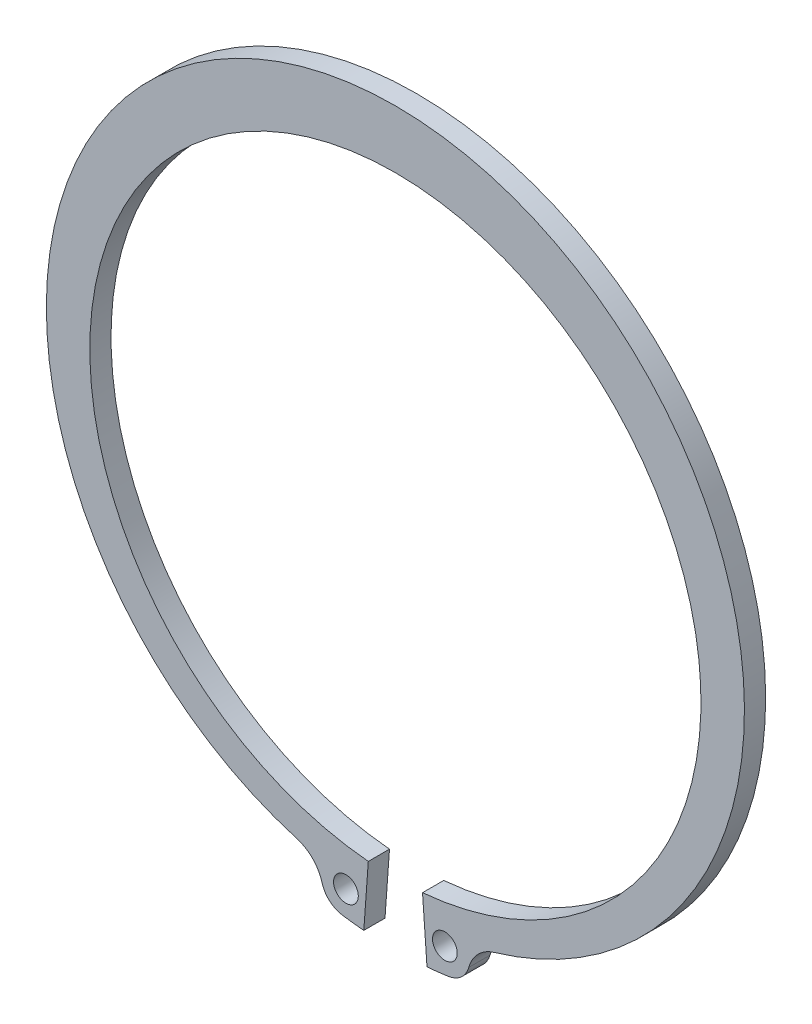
from build123d import *

# Parameters (mm, degrees)
ESQUISSE1_R          = 1.75
BASE_EXTRUSION_DEPTH = 3


with BuildPart() as part:
    # Esquisse1 → Base-Extrusion (new body)
    with BuildSketch(Plane.XY):
        with BuildLine():
            Line((3.836575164, -43.0794985), (4.471865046, -51.85653711))
            ThreePointArc((4.471865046, -51.85653711), (5.992466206, -51.702885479), (7.507900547, -51.504654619))
            ThreePointArc((7.507900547, -51.504654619), (9.318247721, -50.666101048), (10.376287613, -48.974628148))
            ThreePointArc((10.376287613, -48.974628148), (11.693521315, -46.692953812), (13.953275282, -45.33845966))
            ThreePointArc((13.953275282, -45.33845966), (0, 51.45), (-13.953275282, -45.33845966))
            ThreePointArc((-13.953275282, -45.33845966), (-11.693521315, -46.692953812), (-10.376287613, -48.974628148))
            ThreePointArc((-10.376287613, -48.974628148), (-9.318247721, -50.666101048), (-7.507900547, -51.504654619))
            ThreePointArc((-7.507900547, -51.504654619), (-5.992466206, -51.702885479), (-4.471865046, -51.85653711))
            Line((-4.471865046, -51.85653711), (-3.836575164, -43.0794985))
            ThreePointArc((-3.836575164, -43.0794985), (0, 43.25), (3.836575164, -43.0794985))
        make_face()
        with Locations((7.003036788, -48.041258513)):
            Circle(ESQUISSE1_R, mode=Mode.SUBTRACT)
        with Locations(Location((-7.003036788, -48.041258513, 0), (0, 0, 180))):
            Circle(ESQUISSE1_R, mode=Mode.SUBTRACT)
    extrude(amount=BASE_EXTRUSION_DEPTH)


solid = part.part
